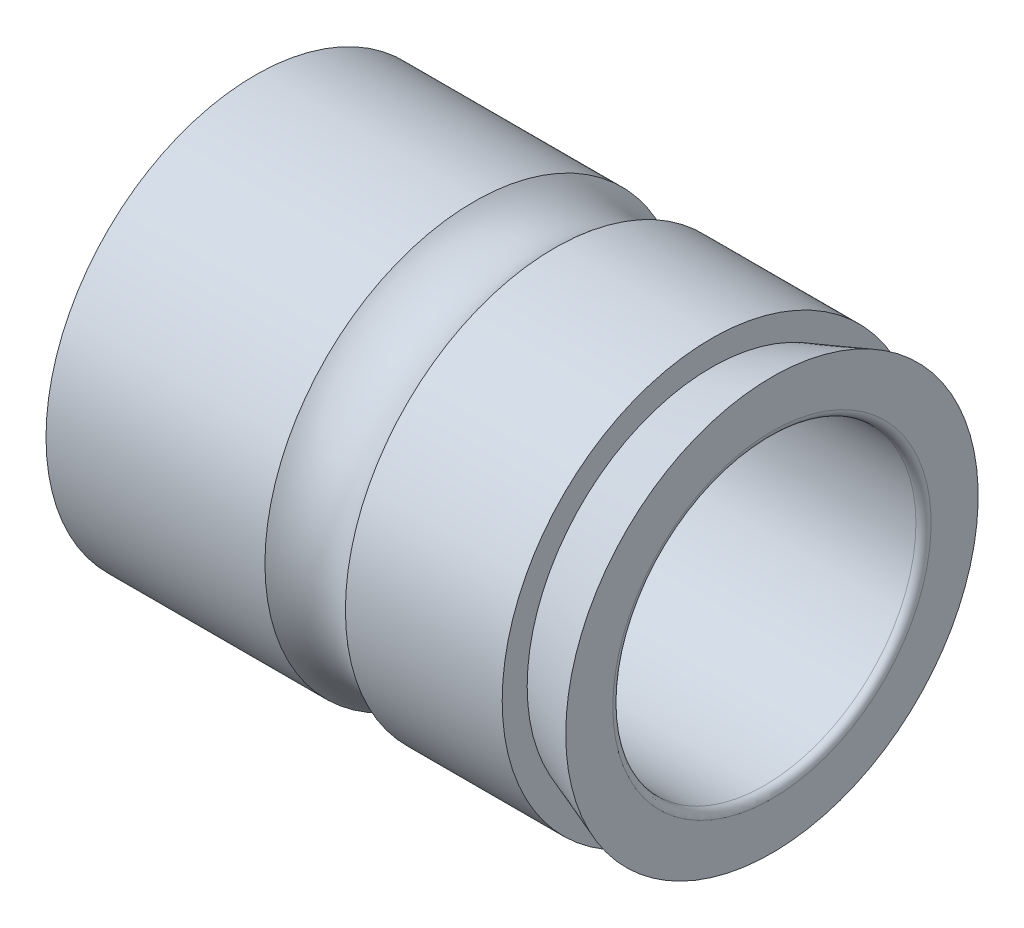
ISO-10303-21;
HEADER;
FILE_DESCRIPTION(('STEP AP214'),'2;1');
FILE_NAME('part.step','',(''),(''),'','','');
FILE_SCHEMA(('AUTOMOTIVE_DESIGN { 1 0 10303 214 1 1 1 1 }'));
ENDSEC;
DATA;
#1=APPLICATION_CONTEXT('core data for automotive mechanical design processes');
#2=APPLICATION_PROTOCOL_DEFINITION('international standard','automotive_design',2000,#1);
#3=PRODUCT_CONTEXT('',#1,'mechanical');
#4=PRODUCT('Part','Part','',(#3));
#5=PRODUCT_RELATED_PRODUCT_CATEGORY('part','',(#4));
#6=PRODUCT_DEFINITION_FORMATION('','',#4);
#7=PRODUCT_DEFINITION_CONTEXT('part definition',#1,'design');
#8=PRODUCT_DEFINITION('design','',#6,#7);
#9=PRODUCT_DEFINITION_SHAPE('','',#8);
#10=(LENGTH_UNIT() NAMED_UNIT(*) SI_UNIT(.MILLI.,.METRE.));
#11=(NAMED_UNIT(*) PLANE_ANGLE_UNIT() SI_UNIT($,.RADIAN.));
#12=(NAMED_UNIT(*) SI_UNIT($,.STERADIAN.) SOLID_ANGLE_UNIT());
#13=UNCERTAINTY_MEASURE_WITH_UNIT(LENGTH_MEASURE(1.E-05),#10,'distance_accuracy_value','');
#14=(GEOMETRIC_REPRESENTATION_CONTEXT(3) GLOBAL_UNCERTAINTY_ASSIGNED_CONTEXT((#13)) GLOBAL_UNIT_ASSIGNED_CONTEXT((#10,
#11,#12)) REPRESENTATION_CONTEXT('',''));
#15=CARTESIAN_POINT('',(0.,0.,0.));
#16=DIRECTION('',(0.,0.,1.));
#17=DIRECTION('',(1.,0.,0.));
#18=AXIS2_PLACEMENT_3D('',#15,#16,#17);
#19=CARTESIAN_POINT('',(-23.2470320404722,52.5,0.));
#20=DIRECTION('',(-1.,0.,0.));
#21=DIRECTION('',(0.,0.,1.));
#22=AXIS2_PLACEMENT_3D('',#19,#20,#21);
#23=CYLINDRICAL_SURFACE('',#22,13.8);
#24=CARTESIAN_POINT('',(-17.1,52.5,0.));
#25=DIRECTION('',(-1.,0.,0.));
#26=DIRECTION('',(0.,0.,1.));
#27=AXIS2_PLACEMENT_3D('',#24,#25,#26);
#28=CIRCLE('',#27,13.8);
#29=CARTESIAN_POINT('',(-17.1,52.5,13.8));
#30=VERTEX_POINT('',#29);
#31=EDGE_CURVE('E10',#30,#30,#28,.T.);
#32=ORIENTED_EDGE('',*,*,#31,.F.);
#33=EDGE_LOOP('',(#32));
#34=FACE_BOUND('',#33,.T.);
#35=CARTESIAN_POINT('',(-2.65527041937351,52.5,0.));
#36=DIRECTION('',(-1.,0.,0.));
#37=DIRECTION('',(0.,0.,1.));
#38=AXIS2_PLACEMENT_3D('',#35,#36,#37);
#39=CIRCLE('',#38,13.8);
#40=CARTESIAN_POINT('',(-2.65527041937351,52.5,13.8));
#41=VERTEX_POINT('',#40);
#42=EDGE_CURVE('E63',#41,#41,#39,.T.);
#43=ORIENTED_EDGE('',*,*,#42,.T.);
#44=EDGE_LOOP('',(#43));
#45=FACE_BOUND('',#44,.T.);
#46=ADVANCED_FACE('F29',(#34,#45),#23,.T.);
#47=CARTESIAN_POINT('',(-17.1,66.3,0.));
#48=DIRECTION('',(1.,0.,0.));
#49=DIRECTION('',(0.,0.,-1.));
#50=AXIS2_PLACEMENT_3D('',#47,#48,#49);
#51=PLANE('',#50);
#52=CARTESIAN_POINT('',(-17.1,52.5,0.));
#53=DIRECTION('',(-1.,0.,0.));
#54=DIRECTION('',(0.,0.,1.));
#55=AXIS2_PLACEMENT_3D('',#52,#53,#54);
#56=CIRCLE('',#55,10.5);
#57=CARTESIAN_POINT('',(-17.1,52.5,10.5));
#58=VERTEX_POINT('',#57);
#59=EDGE_CURVE('E35',#58,#58,#56,.T.);
#60=ORIENTED_EDGE('',*,*,#59,.F.);
#61=EDGE_LOOP('',(#60));
#62=FACE_BOUND('',#61,.T.);
#63=ORIENTED_EDGE('',*,*,#31,.T.);
#64=EDGE_LOOP('',(#63));
#65=FACE_BOUND('',#64,.T.);
#66=ADVANCED_FACE('F112',(#62,#65),#51,.F.);
#67=CARTESIAN_POINT('',(-16.6,52.5,0.));
#68=DIRECTION('',(-1.,0.,0.));
#69=DIRECTION('',(0.,0.,1.));
#70=AXIS2_PLACEMENT_3D('',#67,#68,#69);
#71=TOROIDAL_SURFACE('',#70,10.5,0.5);
#72=CARTESIAN_POINT('',(-16.6,52.5,0.));
#73=DIRECTION('',(-1.,0.,0.));
#74=DIRECTION('',(0.,0.,1.));
#75=AXIS2_PLACEMENT_3D('',#72,#73,#74);
#76=CIRCLE('',#75,10.);
#77=CARTESIAN_POINT('',(-16.6,52.5,10.));
#78=VERTEX_POINT('',#77);
#79=EDGE_CURVE('E39',#78,#78,#76,.T.);
#80=ORIENTED_EDGE('',*,*,#79,.F.);
#81=EDGE_LOOP('',(#80));
#82=FACE_BOUND('',#81,.T.);
#83=ORIENTED_EDGE('',*,*,#59,.T.);
#84=EDGE_LOOP('',(#83));
#85=FACE_BOUND('',#84,.T.);
#86=ADVANCED_FACE('F107',(#82,#85),#71,.T.);
#87=CARTESIAN_POINT('',(-23.2470320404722,52.5,0.));
#88=DIRECTION('',(-1.,0.,0.));
#89=DIRECTION('',(0.,0.,1.));
#90=AXIS2_PLACEMENT_3D('',#87,#88,#89);
#91=CYLINDRICAL_SURFACE('',#90,10.);
#92=CARTESIAN_POINT('',(16.5,52.5,0.));
#93=DIRECTION('',(-1.,0.,0.));
#94=DIRECTION('',(0.,0.,1.));
#95=AXIS2_PLACEMENT_3D('',#92,#93,#94);
#96=CIRCLE('',#95,10.);
#97=CARTESIAN_POINT('',(16.5,52.5,10.));
#98=VERTEX_POINT('',#97);
#99=EDGE_CURVE('E43',#98,#98,#96,.T.);
#100=ORIENTED_EDGE('',*,*,#99,.F.);
#101=EDGE_LOOP('',(#100));
#102=FACE_BOUND('',#101,.T.);
#103=ORIENTED_EDGE('',*,*,#79,.T.);
#104=EDGE_LOOP('',(#103));
#105=FACE_BOUND('',#104,.T.);
#106=ADVANCED_FACE('F101',(#102,#105),#91,.F.);
#107=CARTESIAN_POINT('',(16.5,52.5,0.));
#108=DIRECTION('',(-1.,0.,0.));
#109=DIRECTION('',(0.,0.,1.));
#110=AXIS2_PLACEMENT_3D('',#107,#108,#109);
#111=TOROIDAL_SURFACE('',#110,10.5,0.499999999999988);
#112=CARTESIAN_POINT('',(17.,52.5,0.));
#113=DIRECTION('',(-1.,0.,0.));
#114=DIRECTION('',(0.,0.,1.));
#115=AXIS2_PLACEMENT_3D('',#112,#113,#114);
#116=CIRCLE('',#115,10.5);
#117=CARTESIAN_POINT('',(17.,52.5,10.5));
#118=VERTEX_POINT('',#117);
#119=EDGE_CURVE('E48',#118,#118,#116,.T.);
#120=ORIENTED_EDGE('',*,*,#119,.F.);
#121=EDGE_LOOP('',(#120));
#122=FACE_BOUND('',#121,.T.);
#123=ORIENTED_EDGE('',*,*,#99,.T.);
#124=EDGE_LOOP('',(#123));
#125=FACE_BOUND('',#124,.T.);
#126=ADVANCED_FACE('F95',(#122,#125),#111,.T.);
#127=CARTESIAN_POINT('',(17.,63.,0.));
#128=DIRECTION('',(-1.,0.,0.));
#129=DIRECTION('',(0.,0.,1.));
#130=AXIS2_PLACEMENT_3D('',#127,#128,#129);
#131=PLANE('',#130);
#132=CARTESIAN_POINT('',(17.,52.5,0.));
#133=DIRECTION('',(-1.,0.,0.));
#134=DIRECTION('',(0.,0.,1.));
#135=AXIS2_PLACEMENT_3D('',#132,#133,#134);
#136=CIRCLE('',#135,13.6058809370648);
#137=CARTESIAN_POINT('',(17.,52.5,13.6058809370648));
#138=VERTEX_POINT('',#137);
#139=EDGE_CURVE('E51',#138,#138,#136,.T.);
#140=ORIENTED_EDGE('',*,*,#139,.F.);
#141=EDGE_LOOP('',(#140));
#142=FACE_BOUND('',#141,.T.);
#143=ORIENTED_EDGE('',*,*,#119,.T.);
#144=EDGE_LOOP('',(#143));
#145=FACE_BOUND('',#144,.T.);
#146=ADVANCED_FACE('F89',(#142,#145),#131,.F.);
#147=CARTESIAN_POINT('',(17.,52.5,0.));
#148=DIRECTION('',(1.,0.,0.));
#149=DIRECTION('',(0.,0.,-1.));
#150=AXIS2_PLACEMENT_3D('',#147,#148,#149);
#151=CONICAL_SURFACE('',#150,13.6058809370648,0.349065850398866);
#152=CARTESIAN_POINT('',(13.,52.5,0.));
#153=DIRECTION('',(-1.,0.,0.));
#154=DIRECTION('',(0.,0.,1.));
#155=AXIS2_PLACEMENT_3D('',#152,#153,#154);
#156=CIRCLE('',#155,12.15);
#157=CARTESIAN_POINT('',(13.,52.5,12.15));
#158=VERTEX_POINT('',#157);
#159=EDGE_CURVE('E54',#158,#158,#156,.T.);
#160=ORIENTED_EDGE('',*,*,#159,.F.);
#161=EDGE_LOOP('',(#160));
#162=FACE_BOUND('',#161,.T.);
#163=ORIENTED_EDGE('',*,*,#139,.T.);
#164=EDGE_LOOP('',(#163));
#165=FACE_BOUND('',#164,.T.);
#166=ADVANCED_FACE('F83',(#162,#165),#151,.T.);
#167=CARTESIAN_POINT('',(13.,64.65,0.));
#168=DIRECTION('',(-1.,0.,0.));
#169=DIRECTION('',(0.,0.,1.));
#170=AXIS2_PLACEMENT_3D('',#167,#168,#169);
#171=PLANE('',#170);
#172=CARTESIAN_POINT('',(13.,52.5,0.));
#173=DIRECTION('',(-1.,0.,0.));
#174=DIRECTION('',(0.,0.,1.));
#175=AXIS2_PLACEMENT_3D('',#172,#173,#174);
#176=CIRCLE('',#175,13.8);
#177=CARTESIAN_POINT('',(13.,52.5,13.8));
#178=VERTEX_POINT('',#177);
#179=EDGE_CURVE('E57',#178,#178,#176,.T.);
#180=ORIENTED_EDGE('',*,*,#179,.F.);
#181=EDGE_LOOP('',(#180));
#182=FACE_BOUND('',#181,.T.);
#183=ORIENTED_EDGE('',*,*,#159,.T.);
#184=EDGE_LOOP('',(#183));
#185=FACE_BOUND('',#184,.T.);
#186=ADVANCED_FACE('F77',(#182,#185),#171,.F.);
#187=CARTESIAN_POINT('',(-23.2470320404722,52.5,0.));
#188=DIRECTION('',(-1.,0.,0.));
#189=DIRECTION('',(0.,0.,1.));
#190=AXIS2_PLACEMENT_3D('',#187,#188,#189);
#191=CYLINDRICAL_SURFACE('',#190,13.8);
#192=CARTESIAN_POINT('',(2.65527041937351,52.5,0.));
#193=DIRECTION('',(-1.,0.,0.));
#194=DIRECTION('',(0.,0.,1.));
#195=AXIS2_PLACEMENT_3D('',#192,#193,#194);
#196=CIRCLE('',#195,13.8);
#197=CARTESIAN_POINT('',(2.65527041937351,52.5,13.8));
#198=VERTEX_POINT('',#197);
#199=EDGE_CURVE('E60',#198,#198,#196,.T.);
#200=ORIENTED_EDGE('',*,*,#199,.F.);
#201=EDGE_LOOP('',(#200));
#202=FACE_BOUND('',#201,.T.);
#203=ORIENTED_EDGE('',*,*,#179,.T.);
#204=EDGE_LOOP('',(#203));
#205=FACE_BOUND('',#204,.T.);
#206=ADVANCED_FACE('F71',(#202,#205),#191,.T.);
#207=CARTESIAN_POINT('',(0.,52.5,0.));
#208=DIRECTION('',(-1.,0.,0.));
#209=DIRECTION('',(0.,0.,1.));
#210=AXIS2_PLACEMENT_3D('',#207,#208,#209);
#211=TOROIDAL_SURFACE('',#210,16.75,3.969);
#212=ORIENTED_EDGE('',*,*,#42,.F.);
#213=EDGE_LOOP('',(#212));
#214=FACE_BOUND('',#213,.T.);
#215=ORIENTED_EDGE('',*,*,#199,.T.);
#216=EDGE_LOOP('',(#215));
#217=FACE_BOUND('',#216,.T.);
#218=ADVANCED_FACE('F68',(#214,#217),#211,.F.);
#219=CLOSED_SHELL('',(#46,#66,#86,#106,#126,#146,#166,#186,#206,#218));
#220=MANIFOLD_SOLID_BREP('B2',#219);
#221=ADVANCED_BREP_SHAPE_REPRESENTATION('',(#18,#220),#14);
#222=SHAPE_DEFINITION_REPRESENTATION(#9,#221);
ENDSEC;
END-ISO-10303-21;
